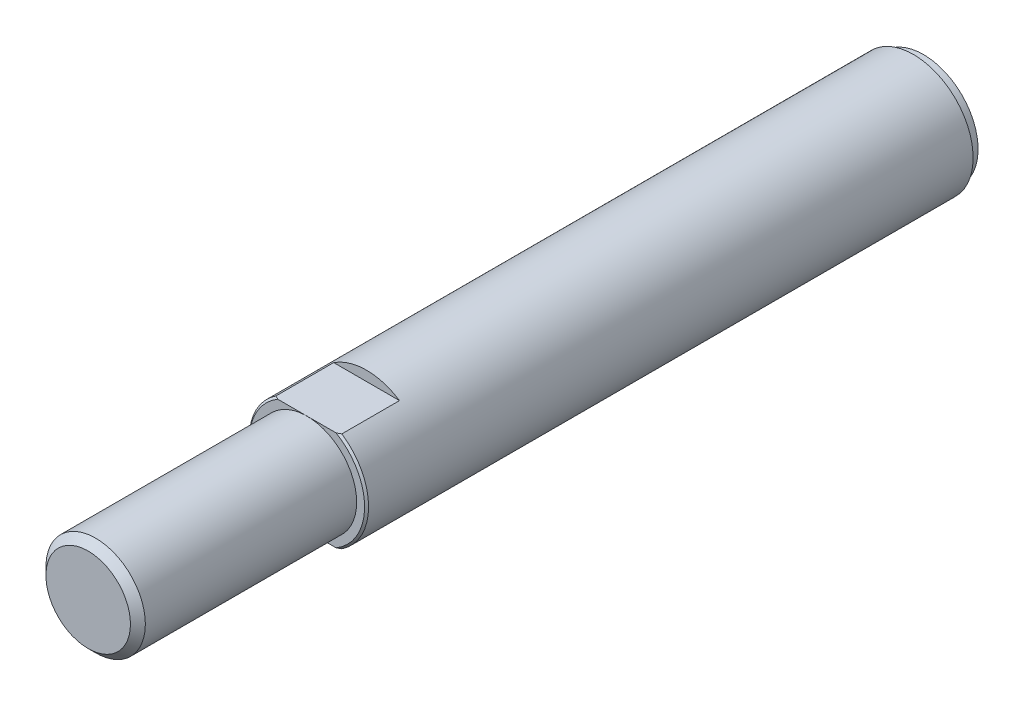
from build123d import *

# Parameters (mm, degrees)
ESBO_O1_R                     = 6
RESSALTO_EXTRUS_O1_DEPTH      = 84
ESBO_O2_OUTSIDE_W             = 31.14
ESBO_O2_OUTSIDE_H             = 31.14
ESBO_O2_OUTSIDE_R             = 5
CORTE_EXTRUS_O1_DEPTH         = 22
FURO_ROSCADO_DE_M6X1_01_D     = 5
FURO_ROSCADO_DE_M6X1_01_DEPTH = 17
FURO_ROSCADO_DE_M6X1_01_TIP   = 1.502151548
ESBO_O5_OUTSIDE_W             = 31.14
ESBO_O5_OUTSIDE_H             = 31.14
ESBO_O5_OUTSIDE_R             = 5.5
CORTE_EXTRUS_O2_DEPTH         = 1
CHANFRO1_SIZE                 = 0.2
CHANFRO2_SIZE                 = 0.75
ESBO_O6_OUTSIDE_W             = 31.14
ESBO_O6_OUTSIDE_H             = 31.14
ESBO_O6_OUTSIDE_W_2           = 17.57164128
ESBO_O6_OUTSIDE_H_2           = 10.01
CORTE_EXTRUS_O3_DEPTH         = 6


with BuildPart() as part:
    # Esbo_o1 → Ressalto-extrus_o1 (new body)
    with BuildSketch(Plane.XY):
        with Locations(Location((0, 0, 0), (0, 0, 180))):
            Circle(ESBO_O1_R)
    extrude(amount=RESSALTO_EXTRUS_O1_DEPTH)

    # Esbo_o2 outside → Corte-extrus_o1 (cut)
    with BuildSketch(Plane.XY.offset(84)):
        Rectangle(ESBO_O2_OUTSIDE_W, ESBO_O2_OUTSIDE_H)
        Circle(ESBO_O2_OUTSIDE_R, mode=Mode.SUBTRACT)
    extrude(amount=-CORTE_EXTRUS_O1_DEPTH, mode=Mode.SUBTRACT)

    # Furo roscado de M6x1.01
    with Locations(Plane(origin=(0, 0, 0), x_dir=(-1, 0, 0), z_dir=(0, 0, -1))):
        with Locations((0, 0)):
            Hole(FURO_ROSCADO_DE_M6X1_01_D / 2, depth=FURO_ROSCADO_DE_M6X1_01_DEPTH)
            with Locations((0, 0, -(FURO_ROSCADO_DE_M6X1_01_DEPTH + FURO_ROSCADO_DE_M6X1_01_TIP / 2))):  # 118° drill point
                Cone(0, FURO_ROSCADO_DE_M6X1_01_D / 2, FURO_ROSCADO_DE_M6X1_01_TIP, mode=Mode.SUBTRACT)

    # Esbo_o5 outside → Corte-extrus_o2 (cut)
    with BuildSketch(Plane(origin=(0, 0, 0), x_dir=(-1, 0, 0), z_dir=(0, 0, -1))):
        Rectangle(ESBO_O5_OUTSIDE_W, ESBO_O5_OUTSIDE_H)
        Circle(ESBO_O5_OUTSIDE_R, mode=Mode.SUBTRACT)
    extrude(amount=-CORTE_EXTRUS_O2_DEPTH, mode=Mode.SUBTRACT)

    # Chanfro1
    chanfro1_edges = [part.edges().sort_by_distance(p)[0] for p in [
        (6, 0, 62),
    ]]
    chamfer(chanfro1_edges, length=CHANFRO1_SIZE)

    # Chanfro2
    chanfro2_edges = [part.edges().sort_by_distance(p)[0] for p in [
        (-5, 0, 84),
    ]]
    chamfer(chanfro2_edges, length=CHANFRO2_SIZE)

    # Esbo_o6 outside → Corte-extrus_o3 (cut)
    with BuildSketch(Plane.XY.offset(62)):
        Rectangle(ESBO_O6_OUTSIDE_W, ESBO_O6_OUTSIDE_H)
        Rectangle(ESBO_O6_OUTSIDE_W_2, ESBO_O6_OUTSIDE_H_2, mode=Mode.SUBTRACT)
    extrude(amount=-CORTE_EXTRUS_O3_DEPTH, mode=Mode.SUBTRACT)


solid = part.part
